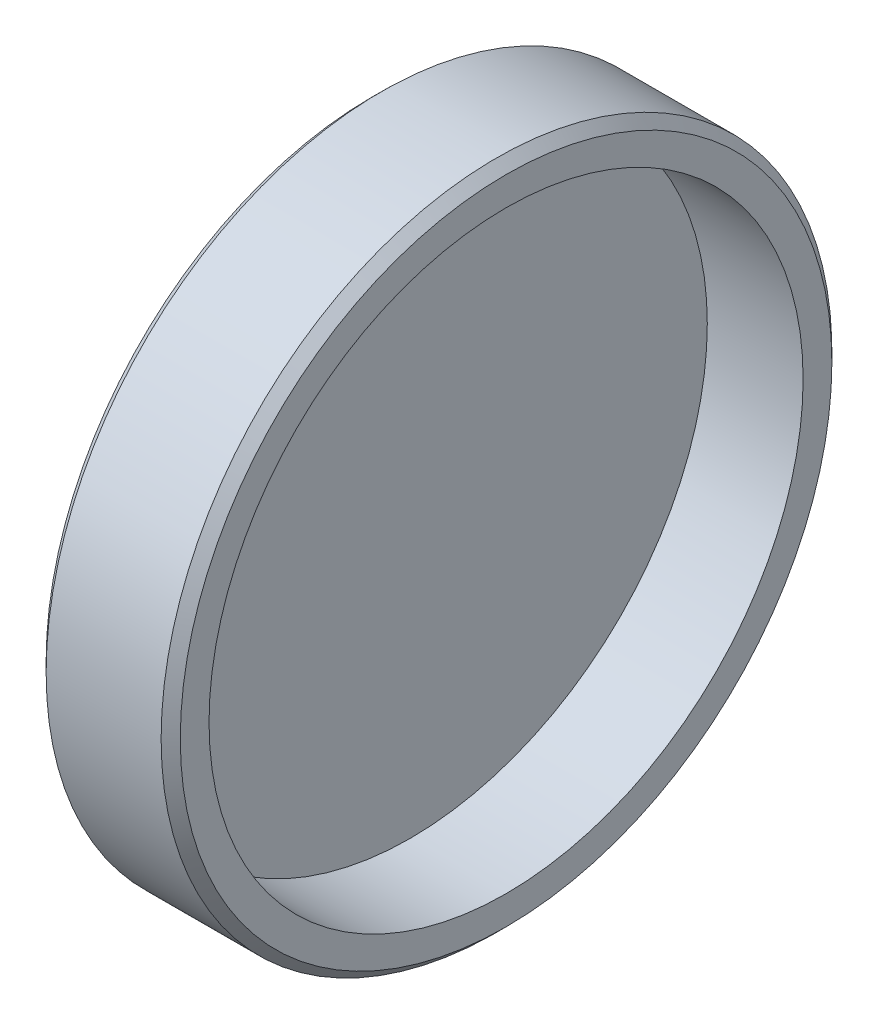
from build123d import *

# Parameters (mm, degrees)
CHANFREIN1_SIZE = 0.5


with BuildPart() as part:
    # Esquisse1 → Base-R_volution (revolve)
    with BuildSketch(Plane.XY, mode=Mode.PRIVATE) as base_r_volution_sk:
        Polygon((0, 0), (2, 0), (2, 15.5), (7, 15.5), (7, 17.5), (0, 17.5), align=None)
    revolve(base_r_volution_sk.sketch.rotate(Axis((0, 0, 0), (1, 0, 0)), 90), axis=Axis((0, 0, 0), (1, 0, 0)))

    # Chanfrein1
    chanfrein1_edges = [part.edges().sort_by_distance(p)[0] for p in [
        (7, 0, -17.5),
        (0, 0, -17.5),
    ]]
    chamfer(chanfrein1_edges, length=CHANFREIN1_SIZE)


solid = part.part
